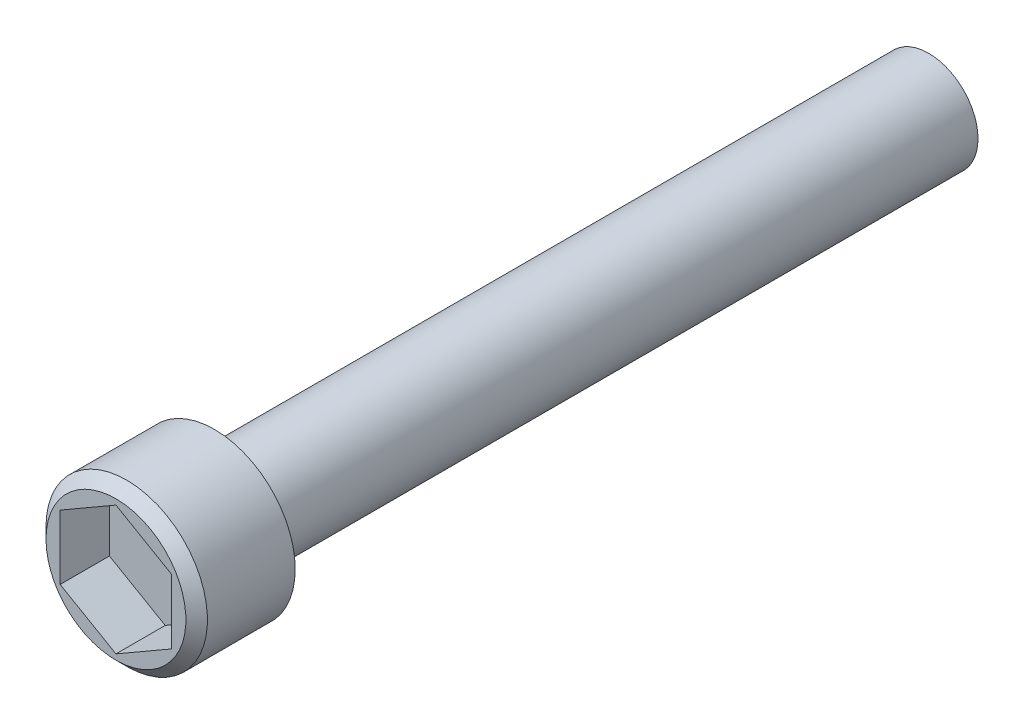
ISO-10303-21;
HEADER;
FILE_DESCRIPTION(('STEP AP214'),'2;1');
FILE_NAME('part.step','',(''),(''),'','','');
FILE_SCHEMA(('AUTOMOTIVE_DESIGN { 1 0 10303 214 1 1 1 1 }'));
ENDSEC;
DATA;
#1=APPLICATION_CONTEXT('core data for automotive mechanical design processes');
#2=APPLICATION_PROTOCOL_DEFINITION('international standard','automotive_design',2000,#1);
#3=PRODUCT_CONTEXT('',#1,'mechanical');
#4=PRODUCT('Part','Part','',(#3));
#5=PRODUCT_RELATED_PRODUCT_CATEGORY('part','',(#4));
#6=PRODUCT_DEFINITION_FORMATION('','',#4);
#7=PRODUCT_DEFINITION_CONTEXT('part definition',#1,'design');
#8=PRODUCT_DEFINITION('design','',#6,#7);
#9=PRODUCT_DEFINITION_SHAPE('','',#8);
#10=(LENGTH_UNIT() NAMED_UNIT(*) SI_UNIT(.MILLI.,.METRE.));
#11=(NAMED_UNIT(*) PLANE_ANGLE_UNIT() SI_UNIT($,.RADIAN.));
#12=(NAMED_UNIT(*) SI_UNIT($,.STERADIAN.) SOLID_ANGLE_UNIT());
#13=UNCERTAINTY_MEASURE_WITH_UNIT(LENGTH_MEASURE(1.E-05),#10,'distance_accuracy_value','');
#14=(GEOMETRIC_REPRESENTATION_CONTEXT(3) GLOBAL_UNCERTAINTY_ASSIGNED_CONTEXT((#13)) GLOBAL_UNIT_ASSIGNED_CONTEXT((#10,
#11,#12)) REPRESENTATION_CONTEXT('',''));
#15=CARTESIAN_POINT('',(0.,0.,0.));
#16=DIRECTION('',(0.,0.,1.));
#17=DIRECTION('',(1.,0.,0.));
#18=AXIS2_PLACEMENT_3D('',#15,#16,#17);
#19=CARTESIAN_POINT('',(0.,0.,25.4));
#20=DIRECTION('',(0.,0.,-1.));
#21=DIRECTION('',(-1.,0.,0.));
#22=AXIS2_PLACEMENT_3D('',#19,#20,#21);
#23=CYLINDRICAL_SURFACE('',#22,1.7526);
#24=CARTESIAN_POINT('',(0.,0.,25.146));
#25=DIRECTION('',(0.,0.,1.));
#26=DIRECTION('',(1.,0.,0.));
#27=AXIS2_PLACEMENT_3D('',#24,#25,#26);
#28=CIRCLE('',#27,1.7526);
#29=CARTESIAN_POINT('',(1.7526,0.,25.146));
#30=VERTEX_POINT('',#29);
#31=EDGE_CURVE('E149',#30,#30,#28,.F.);
#32=ORIENTED_EDGE('',*,*,#31,.T.);
#33=EDGE_LOOP('',(#32));
#34=FACE_BOUND('',#33,.T.);
#35=CARTESIAN_POINT('',(0.,0.,0.));
#36=DIRECTION('',(0.,0.,1.));
#37=DIRECTION('',(1.,0.,0.));
#38=AXIS2_PLACEMENT_3D('',#35,#36,#37);
#39=CIRCLE('',#38,1.7526);
#40=CARTESIAN_POINT('',(1.7526,0.,0.));
#41=VERTEX_POINT('',#40);
#42=EDGE_CURVE('E143',#41,#41,#39,.T.);
#43=ORIENTED_EDGE('',*,*,#42,.T.);
#44=EDGE_LOOP('',(#43));
#45=FACE_BOUND('',#44,.T.);
#46=ADVANCED_FACE('F36',(#34,#45),#23,.T.);
#47=CARTESIAN_POINT('',(0.,0.,0.));
#48=DIRECTION('',(0.,0.,1.));
#49=DIRECTION('',(1.,0.,0.));
#50=AXIS2_PLACEMENT_3D('',#47,#48,#49);
#51=PLANE('',#50);
#52=ORIENTED_EDGE('',*,*,#42,.F.);
#53=EDGE_LOOP('',(#52));
#54=FACE_BOUND('',#53,.T.);
#55=ADVANCED_FACE('F167',(#54),#51,.F.);
#56=CARTESIAN_POINT('',(0.,0.,25.4));
#57=DIRECTION('',(0.,0.,1.));
#58=DIRECTION('',(1.,0.,0.));
#59=AXIS2_PLACEMENT_3D('',#56,#57,#58);
#60=PLANE('',#59);
#61=CARTESIAN_POINT('',(0.,0.,25.4));
#62=DIRECTION('',(0.,0.,1.));
#63=DIRECTION('',(1.,0.,0.));
#64=AXIS2_PLACEMENT_3D('',#61,#62,#63);
#65=CIRCLE('',#64,2.0066);
#66=CARTESIAN_POINT('',(2.0066,0.,25.4));
#67=VERTEX_POINT('',#66);
#68=EDGE_CURVE('E146',#67,#67,#65,.T.);
#69=ORIENTED_EDGE('',*,*,#68,.T.);
#70=EDGE_LOOP('',(#69));
#71=FACE_BOUND('',#70,.T.);
#72=CARTESIAN_POINT('',(0.,0.,25.4));
#73=DIRECTION('',(0.,0.,1.));
#74=DIRECTION('',(1.,0.,0.));
#75=AXIS2_PLACEMENT_3D('',#72,#73,#74);
#76=CIRCLE('',#75,2.8702);
#77=CARTESIAN_POINT('',(2.8702,0.,25.4));
#78=VERTEX_POINT('',#77);
#79=EDGE_CURVE('E134',#78,#78,#76,.T.);
#80=ORIENTED_EDGE('',*,*,#79,.F.);
#81=EDGE_LOOP('',(#80));
#82=FACE_BOUND('',#81,.T.);
#83=ADVANCED_FACE('F172',(#71,#82),#60,.F.);
#84=CARTESIAN_POINT('',(0.,0.,28.9052));
#85=DIRECTION('',(0.,0.,-1.));
#86=DIRECTION('',(-1.,0.,0.));
#87=AXIS2_PLACEMENT_3D('',#84,#85,#86);
#88=CYLINDRICAL_SURFACE('',#87,2.8702);
#89=CARTESIAN_POINT('',(0.,0.,28.5225066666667));
#90=DIRECTION('',(0.,0.,1.));
#91=DIRECTION('',(1.,0.,0.));
#92=AXIS2_PLACEMENT_3D('',#89,#90,#91);
#93=CIRCLE('',#92,2.8702);
#94=CARTESIAN_POINT('',(-2.8702,0.,28.5225066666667));
#95=VERTEX_POINT('',#94);
#96=EDGE_CURVE('E11',#95,#95,#93,.F.);
#97=ORIENTED_EDGE('',*,*,#96,.T.);
#98=EDGE_LOOP('',(#97));
#99=FACE_BOUND('',#98,.T.);
#100=ORIENTED_EDGE('',*,*,#79,.T.);
#101=EDGE_LOOP('',(#100));
#102=FACE_BOUND('',#101,.T.);
#103=ADVANCED_FACE('F187',(#99,#102),#88,.T.);
#104=CARTESIAN_POINT('',(0.,0.,28.9052));
#105=DIRECTION('',(0.,0.,1.));
#106=DIRECTION('',(1.,0.,0.));
#107=AXIS2_PLACEMENT_3D('',#104,#105,#106);
#108=PLANE('',#107);
#109=CARTESIAN_POINT('',(0.,0.,28.9052));
#110=DIRECTION('',(0.,0.,1.));
#111=DIRECTION('',(1.,0.,0.));
#112=AXIS2_PLACEMENT_3D('',#109,#110,#111);
#113=CIRCLE('',#112,2.48750666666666);
#114=CARTESIAN_POINT('',(-2.48750666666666,0.,28.9052));
#115=VERTEX_POINT('',#114);
#116=EDGE_CURVE('E43',#115,#115,#113,.T.);
#117=ORIENTED_EDGE('',*,*,#116,.T.);
#118=EDGE_LOOP('',(#117));
#119=FACE_BOUND('',#118,.T.);
#120=DIRECTION('',(-0.866025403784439,-0.5,0.));
#121=VECTOR('',#120,1.);
#122=CARTESIAN_POINT('',(0.,2.29135888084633,28.9052000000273));
#123=LINE('',#122,#121);
#124=CARTESIAN_POINT('',(0.,2.29135888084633,28.9052000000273));
#125=VERTEX_POINT('',#124);
#126=CARTESIAN_POINT('',(-1.984375,1.14567944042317,28.9052));
#127=VERTEX_POINT('',#126);
#128=EDGE_CURVE('E50',#125,#127,#123,.T.);
#129=ORIENTED_EDGE('',*,*,#128,.F.);
#130=DIRECTION('',(0.866025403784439,-0.5,0.));
#131=VECTOR('',#130,1.);
#132=CARTESIAN_POINT('',(0.,2.29135888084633,28.9052000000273));
#133=LINE('',#132,#131);
#134=CARTESIAN_POINT('',(1.984375,1.14567944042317,28.9052000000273));
#135=VERTEX_POINT('',#134);
#136=EDGE_CURVE('E117',#125,#135,#133,.T.);
#137=ORIENTED_EDGE('',*,*,#136,.T.);
#138=DIRECTION('',(0.,-1.,0.));
#139=VECTOR('',#138,1.);
#140=CARTESIAN_POINT('',(1.984375,1.14567944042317,28.9052000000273));
#141=LINE('',#140,#139);
#142=CARTESIAN_POINT('',(1.984375,-1.14567944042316,28.9052000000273));
#143=VERTEX_POINT('',#142);
#144=EDGE_CURVE('E112',#135,#143,#141,.T.);
#145=ORIENTED_EDGE('',*,*,#144,.T.);
#146=DIRECTION('',(0.866025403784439,0.5,0.));
#147=VECTOR('',#146,1.);
#148=CARTESIAN_POINT('',(0.,-2.29135888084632,28.9052000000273));
#149=LINE('',#148,#147);
#150=CARTESIAN_POINT('',(0.,-2.29135888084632,28.9052000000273));
#151=VERTEX_POINT('',#150);
#152=EDGE_CURVE('E110',#151,#143,#149,.T.);
#153=ORIENTED_EDGE('',*,*,#152,.F.);
#154=DIRECTION('',(-0.866025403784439,0.5,0.));
#155=VECTOR('',#154,1.);
#156=CARTESIAN_POINT('',(0.,-2.29135888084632,28.9052000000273));
#157=LINE('',#156,#155);
#158=CARTESIAN_POINT('',(-1.984375,-1.14567944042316,28.9052000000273));
#159=VERTEX_POINT('',#158);
#160=EDGE_CURVE('E92',#151,#159,#157,.T.);
#161=ORIENTED_EDGE('',*,*,#160,.T.);
#162=DIRECTION('',(0.,-1.,0.));
#163=VECTOR('',#162,1.);
#164=CARTESIAN_POINT('',(-1.984375,1.14567944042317,28.9052000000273));
#165=LINE('',#164,#163);
#166=EDGE_CURVE('E103',#127,#159,#165,.T.);
#167=ORIENTED_EDGE('',*,*,#166,.F.);
#168=EDGE_LOOP('',(#129,#137,#145,#153,#161,#167));
#169=FACE_BOUND('',#168,.T.);
#170=ADVANCED_FACE('F107',(#119,#169),#108,.T.);
#171=CARTESIAN_POINT('',(0.,0.,25.146));
#172=DIRECTION('',(0.,0.,1.));
#173=DIRECTION('',(1.,0.,0.));
#174=AXIS2_PLACEMENT_3D('',#171,#172,#173);
#175=TOROIDAL_SURFACE('',#174,2.0066,0.254);
#176=ORIENTED_EDGE('',*,*,#31,.F.);
#177=EDGE_LOOP('',(#176));
#178=FACE_BOUND('',#177,.T.);
#179=ORIENTED_EDGE('',*,*,#68,.F.);
#180=EDGE_LOOP('',(#179));
#181=FACE_BOUND('',#180,.T.);
#182=ADVANCED_FACE('F178',(#178,#181),#175,.F.);
#183=CARTESIAN_POINT('',(0.,2.29135888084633,27.1526000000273));
#184=DIRECTION('',(-0.5,0.866025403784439,0.));
#185=DIRECTION('',(-0.866025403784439,-0.5,0.));
#186=AXIS2_PLACEMENT_3D('',#183,#184,#185);
#187=PLANE('',#186);
#188=ORIENTED_EDGE('',*,*,#128,.T.);
#189=DIRECTION('',(0.,0.,1.));
#190=VECTOR('',#189,1.);
#191=CARTESIAN_POINT('',(-1.984375,1.14567944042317,27.1526000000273));
#192=LINE('',#191,#190);
#193=CARTESIAN_POINT('',(-1.984375,1.14567944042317,27.1526000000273));
#194=VERTEX_POINT('',#193);
#195=EDGE_CURVE('E100',#194,#127,#192,.T.);
#196=ORIENTED_EDGE('',*,*,#195,.F.);
#197=DIRECTION('',(-0.866025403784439,-0.5,0.));
#198=VECTOR('',#197,1.);
#199=CARTESIAN_POINT('',(0.,2.29135888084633,27.1526000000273));
#200=LINE('',#199,#198);
#201=CARTESIAN_POINT('',(0.,2.29135888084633,27.1526000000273));
#202=VERTEX_POINT('',#201);
#203=EDGE_CURVE('E120',#202,#194,#200,.T.);
#204=ORIENTED_EDGE('',*,*,#203,.F.);
#205=DIRECTION('',(0.,0.,1.));
#206=VECTOR('',#205,1.);
#207=CARTESIAN_POINT('',(0.,2.29135888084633,27.1526000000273));
#208=LINE('',#207,#206);
#209=EDGE_CURVE('E57',#202,#125,#208,.T.);
#210=ORIENTED_EDGE('',*,*,#209,.T.);
#211=EDGE_LOOP('',(#188,#196,#204,#210));
#212=FACE_BOUND('',#211,.T.);
#213=ADVANCED_FACE('F181',(#212),#187,.F.);
#214=CARTESIAN_POINT('',(0.,2.29135888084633,27.1526000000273));
#215=DIRECTION('',(-0.5,-0.866025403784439,0.));
#216=DIRECTION('',(0.866025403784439,-0.5,0.));
#217=AXIS2_PLACEMENT_3D('',#214,#215,#216);
#218=PLANE('',#217);
#219=ORIENTED_EDGE('',*,*,#136,.F.);
#220=ORIENTED_EDGE('',*,*,#209,.F.);
#221=DIRECTION('',(0.866025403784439,-0.5,0.));
#222=VECTOR('',#221,1.);
#223=CARTESIAN_POINT('',(0.,2.29135888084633,27.1526000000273));
#224=LINE('',#223,#222);
#225=CARTESIAN_POINT('',(1.984375,1.14567944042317,27.1526000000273));
#226=VERTEX_POINT('',#225);
#227=EDGE_CURVE('E131',#202,#226,#224,.T.);
#228=ORIENTED_EDGE('',*,*,#227,.T.);
#229=DIRECTION('',(0.,0.,1.));
#230=VECTOR('',#229,1.);
#231=CARTESIAN_POINT('',(1.984375,1.14567944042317,27.1526000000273));
#232=LINE('',#231,#230);
#233=EDGE_CURVE('E135',#226,#135,#232,.T.);
#234=ORIENTED_EDGE('',*,*,#233,.T.);
#235=EDGE_LOOP('',(#219,#220,#228,#234));
#236=FACE_BOUND('',#235,.T.);
#237=ADVANCED_FACE('F201',(#236),#218,.T.);
#238=CARTESIAN_POINT('',(1.984375,1.14567944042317,27.1526000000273));
#239=DIRECTION('',(-1.,0.,0.));
#240=DIRECTION('',(0.,0.,1.));
#241=AXIS2_PLACEMENT_3D('',#238,#239,#240);
#242=PLANE('',#241);
#243=ORIENTED_EDGE('',*,*,#144,.F.);
#244=ORIENTED_EDGE('',*,*,#233,.F.);
#245=DIRECTION('',(0.,-1.,0.));
#246=VECTOR('',#245,1.);
#247=CARTESIAN_POINT('',(1.984375,1.14567944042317,27.1526000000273));
#248=LINE('',#247,#246);
#249=CARTESIAN_POINT('',(1.984375,-1.14567944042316,27.1526000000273));
#250=VERTEX_POINT('',#249);
#251=EDGE_CURVE('E129',#226,#250,#248,.T.);
#252=ORIENTED_EDGE('',*,*,#251,.T.);
#253=DIRECTION('',(0.,0.,1.));
#254=VECTOR('',#253,1.);
#255=CARTESIAN_POINT('',(1.984375,-1.14567944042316,27.1526000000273));
#256=LINE('',#255,#254);
#257=EDGE_CURVE('E137',#250,#143,#256,.T.);
#258=ORIENTED_EDGE('',*,*,#257,.T.);
#259=EDGE_LOOP('',(#243,#244,#252,#258));
#260=FACE_BOUND('',#259,.T.);
#261=ADVANCED_FACE('F209',(#260),#242,.T.);
#262=CARTESIAN_POINT('',(0.,-2.29135888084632,27.1526000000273));
#263=DIRECTION('',(0.5,-0.866025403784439,0.));
#264=DIRECTION('',(0.866025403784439,0.5,0.));
#265=AXIS2_PLACEMENT_3D('',#262,#263,#264);
#266=PLANE('',#265);
#267=ORIENTED_EDGE('',*,*,#152,.T.);
#268=ORIENTED_EDGE('',*,*,#257,.F.);
#269=DIRECTION('',(0.866025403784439,0.5,0.));
#270=VECTOR('',#269,1.);
#271=CARTESIAN_POINT('',(0.,-2.29135888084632,27.1526000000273));
#272=LINE('',#271,#270);
#273=CARTESIAN_POINT('',(0.,-2.29135888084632,27.1526000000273));
#274=VERTEX_POINT('',#273);
#275=EDGE_CURVE('E126',#274,#250,#272,.T.);
#276=ORIENTED_EDGE('',*,*,#275,.F.);
#277=DIRECTION('',(0.,0.,1.));
#278=VECTOR('',#277,1.);
#279=CARTESIAN_POINT('',(0.,-2.29135888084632,27.1526000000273));
#280=LINE('',#279,#278);
#281=EDGE_CURVE('E99',#274,#151,#280,.T.);
#282=ORIENTED_EDGE('',*,*,#281,.T.);
#283=EDGE_LOOP('',(#267,#268,#276,#282));
#284=FACE_BOUND('',#283,.T.);
#285=ADVANCED_FACE('F206',(#284),#266,.F.);
#286=CARTESIAN_POINT('',(0.,-2.29135888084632,27.1526000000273));
#287=DIRECTION('',(0.5,0.866025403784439,0.));
#288=DIRECTION('',(-0.866025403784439,0.5,0.));
#289=AXIS2_PLACEMENT_3D('',#286,#287,#288);
#290=PLANE('',#289);
#291=ORIENTED_EDGE('',*,*,#160,.F.);
#292=ORIENTED_EDGE('',*,*,#281,.F.);
#293=DIRECTION('',(-0.866025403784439,0.5,0.));
#294=VECTOR('',#293,1.);
#295=CARTESIAN_POINT('',(0.,-2.29135888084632,27.1526000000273));
#296=LINE('',#295,#294);
#297=CARTESIAN_POINT('',(-1.984375,-1.14567944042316,27.1526000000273));
#298=VERTEX_POINT('',#297);
#299=EDGE_CURVE('E95',#274,#298,#296,.T.);
#300=ORIENTED_EDGE('',*,*,#299,.T.);
#301=DIRECTION('',(0.,0.,1.));
#302=VECTOR('',#301,1.);
#303=CARTESIAN_POINT('',(-1.984375,-1.14567944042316,27.1526000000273));
#304=LINE('',#303,#302);
#305=EDGE_CURVE('E88',#298,#159,#304,.T.);
#306=ORIENTED_EDGE('',*,*,#305,.T.);
#307=EDGE_LOOP('',(#291,#292,#300,#306));
#308=FACE_BOUND('',#307,.T.);
#309=ADVANCED_FACE('F90',(#308),#290,.T.);
#310=CARTESIAN_POINT('',(-1.984375,1.14567944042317,27.1526000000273));
#311=DIRECTION('',(-1.,0.,0.));
#312=DIRECTION('',(0.,0.,1.));
#313=AXIS2_PLACEMENT_3D('',#310,#311,#312);
#314=PLANE('',#313);
#315=ORIENTED_EDGE('',*,*,#166,.T.);
#316=ORIENTED_EDGE('',*,*,#305,.F.);
#317=DIRECTION('',(0.,-1.,0.));
#318=VECTOR('',#317,1.);
#319=CARTESIAN_POINT('',(-1.984375,1.14567944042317,27.1526000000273));
#320=LINE('',#319,#318);
#321=EDGE_CURVE('E123',#194,#298,#320,.T.);
#322=ORIENTED_EDGE('',*,*,#321,.F.);
#323=ORIENTED_EDGE('',*,*,#195,.T.);
#324=EDGE_LOOP('',(#315,#316,#322,#323));
#325=FACE_BOUND('',#324,.T.);
#326=ADVANCED_FACE('F104',(#325),#314,.F.);
#327=CARTESIAN_POINT('',(-3.96875,0.,27.1526000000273));
#328=DIRECTION('',(0.,0.,-1.));
#329=DIRECTION('',(-1.,0.,0.));
#330=AXIS2_PLACEMENT_3D('',#327,#328,#329);
#331=PLANE('',#330);
#332=ORIENTED_EDGE('',*,*,#203,.T.);
#333=ORIENTED_EDGE('',*,*,#321,.T.);
#334=ORIENTED_EDGE('',*,*,#299,.F.);
#335=ORIENTED_EDGE('',*,*,#275,.T.);
#336=ORIENTED_EDGE('',*,*,#251,.F.);
#337=ORIENTED_EDGE('',*,*,#227,.F.);
#338=EDGE_LOOP('',(#332,#333,#334,#335,#336,#337));
#339=FACE_BOUND('',#338,.T.);
#340=ADVANCED_FACE('F157',(#339),#331,.F.);
#341=CARTESIAN_POINT('',(0.,0.,28.9052));
#342=DIRECTION('',(0.,0.,-1.));
#343=DIRECTION('',(-1.,0.,0.));
#344=AXIS2_PLACEMENT_3D('',#341,#342,#343);
#345=CONICAL_SURFACE('',#344,2.48750666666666,0.785398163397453);
#346=CARTESIAN_POINT('',(-2.8702,0.,28.5225066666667));
#347=CARTESIAN_POINT('',(-2.86621361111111,0.,28.5264930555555));
#348=CARTESIAN_POINT('',(-2.86222722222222,0.,28.5304794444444));
#349=CARTESIAN_POINT('',(-2.85425444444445,0.,28.5384522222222));
#350=CARTESIAN_POINT('',(-2.85026805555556,0.,28.5424386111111));
#351=CARTESIAN_POINT('',(-2.84229527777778,0.,28.5504113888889));
#352=CARTESIAN_POINT('',(-2.83830888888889,0.,28.5543977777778));
#353=CARTESIAN_POINT('',(-2.83033611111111,0.,28.5623705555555));
#354=CARTESIAN_POINT('',(-2.82634972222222,0.,28.5663569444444));
#355=CARTESIAN_POINT('',(-2.81837694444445,0.,28.5743297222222));
#356=CARTESIAN_POINT('',(-2.81439055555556,0.,28.5783161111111));
#357=CARTESIAN_POINT('',(-2.80641777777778,0.,28.5862888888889));
#358=CARTESIAN_POINT('',(-2.80243138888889,0.,28.5902752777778));
#359=CARTESIAN_POINT('',(-2.79445861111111,0.,28.5982480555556));
#360=CARTESIAN_POINT('',(-2.79047222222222,0.,28.6022344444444));
#361=CARTESIAN_POINT('',(-2.78249944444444,0.,28.6102072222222));
#362=CARTESIAN_POINT('',(-2.77851305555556,0.,28.6141936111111));
#363=CARTESIAN_POINT('',(-2.77054027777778,0.,28.6221663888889));
#364=CARTESIAN_POINT('',(-2.76655388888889,0.,28.6261527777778));
#365=CARTESIAN_POINT('',(-2.75858111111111,0.,28.6341255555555));
#366=CARTESIAN_POINT('',(-2.75459472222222,0.,28.6381119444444));
#367=CARTESIAN_POINT('',(-2.74662194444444,0.,28.6460847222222));
#368=CARTESIAN_POINT('',(-2.74263555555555,0.,28.6500711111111));
#369=CARTESIAN_POINT('',(-2.73466277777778,0.,28.6580438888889));
#370=CARTESIAN_POINT('',(-2.73067638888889,0.,28.6620302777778));
#371=CARTESIAN_POINT('',(-2.72270361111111,0.,28.6700030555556));
#372=CARTESIAN_POINT('',(-2.71871722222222,0.,28.6739894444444));
#373=CARTESIAN_POINT('',(-2.71074444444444,0.,28.6819622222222));
#374=CARTESIAN_POINT('',(-2.70675805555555,0.,28.6859486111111));
#375=CARTESIAN_POINT('',(-2.69878527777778,0.,28.6939213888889));
#376=CARTESIAN_POINT('',(-2.69479888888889,0.,28.6979077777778));
#377=CARTESIAN_POINT('',(-2.68682611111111,0.,28.7058805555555));
#378=CARTESIAN_POINT('',(-2.68283972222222,0.,28.7098669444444));
#379=CARTESIAN_POINT('',(-2.67486694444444,0.,28.7178397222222));
#380=CARTESIAN_POINT('',(-2.67088055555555,0.,28.7218261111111));
#381=CARTESIAN_POINT('',(-2.66290777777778,0.,28.7297988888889));
#382=CARTESIAN_POINT('',(-2.65892138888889,0.,28.7337852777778));
#383=CARTESIAN_POINT('',(-2.65094861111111,0.,28.7417580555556));
#384=CARTESIAN_POINT('',(-2.64696222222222,0.,28.7457444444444));
#385=CARTESIAN_POINT('',(-2.63898944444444,0.,28.7537172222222));
#386=CARTESIAN_POINT('',(-2.63500305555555,0.,28.7577036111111));
#387=CARTESIAN_POINT('',(-2.62703027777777,0.,28.7656763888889));
#388=CARTESIAN_POINT('',(-2.62304388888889,0.,28.7696627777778));
#389=CARTESIAN_POINT('',(-2.61507111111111,0.,28.7776355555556));
#390=CARTESIAN_POINT('',(-2.61108472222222,0.,28.7816219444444));
#391=CARTESIAN_POINT('',(-2.60311194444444,0.,28.7895947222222));
#392=CARTESIAN_POINT('',(-2.59912555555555,0.,28.7935811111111));
#393=CARTESIAN_POINT('',(-2.59115277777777,0.,28.8015538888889));
#394=CARTESIAN_POINT('',(-2.58716638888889,0.,28.8055402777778));
#395=CARTESIAN_POINT('',(-2.57919361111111,0.,28.8135130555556));
#396=CARTESIAN_POINT('',(-2.57520722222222,0.,28.8174994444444));
#397=CARTESIAN_POINT('',(-2.56723444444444,0.,28.8254722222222));
#398=CARTESIAN_POINT('',(-2.56324805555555,0.,28.8294586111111));
#399=CARTESIAN_POINT('',(-2.55527527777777,0.,28.8374313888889));
#400=CARTESIAN_POINT('',(-2.55128888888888,0.,28.8414177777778));
#401=CARTESIAN_POINT('',(-2.54331611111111,0.,28.8493905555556));
#402=CARTESIAN_POINT('',(-2.53932972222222,0.,28.8533769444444));
#403=CARTESIAN_POINT('',(-2.53135694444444,0.,28.8613497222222));
#404=CARTESIAN_POINT('',(-2.52737055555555,0.,28.8653361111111));
#405=CARTESIAN_POINT('',(-2.51939777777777,0.,28.8733088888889));
#406=CARTESIAN_POINT('',(-2.51541138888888,0.,28.8772952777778));
#407=CARTESIAN_POINT('',(-2.50743861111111,0.,28.8852680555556));
#408=CARTESIAN_POINT('',(-2.50345222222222,0.,28.8892544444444));
#409=CARTESIAN_POINT('',(-2.49547944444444,0.,28.8972272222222));
#410=CARTESIAN_POINT('',(-2.49149305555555,0.,28.9012136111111));
#411=CARTESIAN_POINT('',(-2.48750666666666,0.,28.9052));
#412=B_SPLINE_CURVE_WITH_KNOTS('',3,(#346,#347,#348,#349,#350,#351,#352,#353,#354,#355,#356,
#357,#358,#359,#360,#361,#362,#363,#364,#365,#366,#367,#368,#369,#370,#371,#372,#373,#374,#375,
#376,#377,#378,#379,#380,#381,#382,#383,#384,#385,#386,#387,#388,#389,#390,#391,#392,#393,#394,
#395,#396,#397,#398,#399,#400,#401,#402,#403,#404,#405,#406,#407,#408,#409,#410,#411),
.UNSPECIFIED.,.F.,.F.,(4,2,2,2,2,2,2,2,2,2,2,2,2,2,2,2,2,2,2,2,2,2,2,2,2,2,2,2,2,2,2,2,4),(0.,
0.0169128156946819,0.0338256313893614,0.0507384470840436,0.067651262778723,0.0845640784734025,
0.101476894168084,0.118389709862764,0.135302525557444,0.152215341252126,0.169128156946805,
0.186040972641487,0.202953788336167,0.219866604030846,0.236779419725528,0.253692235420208,
0.270605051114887,0.287517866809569,0.304430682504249,0.321343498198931,0.33825631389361,
0.35516912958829,0.372081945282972,0.388994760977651,0.405907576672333,0.422820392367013,
0.439733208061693,0.456646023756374,0.473558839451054,0.490471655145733,0.507384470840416,
0.524297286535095,0.541210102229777),.UNSPECIFIED.);
#413=EDGE_CURVE('BSEAM155',#95,#115,#412,.T.);
#414=ORIENTED_EDGE('',*,*,#96,.F.);
#415=ORIENTED_EDGE('',*,*,#116,.F.);
#416=ORIENTED_EDGE('',*,*,#413,.T.);
#417=ORIENTED_EDGE('',*,*,#413,.F.);
#418=EDGE_LOOP('',(#414,#416,#415,#417));
#419=FACE_BOUND('',#418,.T.);
#420=ADVANCED_FACE('F155',(#419),#345,.T.);
#421=CLOSED_SHELL('',(#46,#55,#83,#103,#170,#182,#213,#237,#261,#285,#309,#326,#340,#420));
#422=MANIFOLD_SOLID_BREP('B2',#421);
#423=ADVANCED_BREP_SHAPE_REPRESENTATION('',(#18,#422),#14);
#424=SHAPE_DEFINITION_REPRESENTATION(#9,#423);
ENDSEC;
END-ISO-10303-21;
